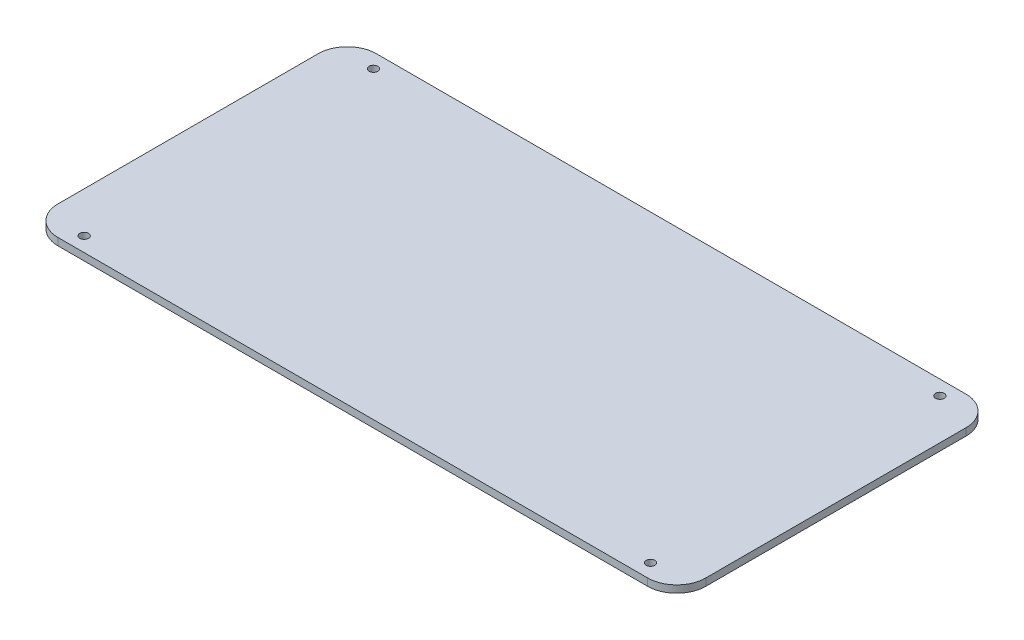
ISO-10303-21;
HEADER;
FILE_DESCRIPTION(('STEP AP214'),'2;1');
FILE_NAME('part.step','',(''),(''),'','','');
FILE_SCHEMA(('AUTOMOTIVE_DESIGN { 1 0 10303 214 1 1 1 1 }'));
ENDSEC;
DATA;
#1=APPLICATION_CONTEXT('core data for automotive mechanical design processes');
#2=APPLICATION_PROTOCOL_DEFINITION('international standard','automotive_design',2000,#1);
#3=PRODUCT_CONTEXT('',#1,'mechanical');
#4=PRODUCT('Part','Part','',(#3));
#5=PRODUCT_RELATED_PRODUCT_CATEGORY('part','',(#4));
#6=PRODUCT_DEFINITION_FORMATION('','',#4);
#7=PRODUCT_DEFINITION_CONTEXT('part definition',#1,'design');
#8=PRODUCT_DEFINITION('design','',#6,#7);
#9=PRODUCT_DEFINITION_SHAPE('','',#8);
#10=(LENGTH_UNIT() NAMED_UNIT(*) SI_UNIT(.MILLI.,.METRE.));
#11=(NAMED_UNIT(*) PLANE_ANGLE_UNIT() SI_UNIT($,.RADIAN.));
#12=(NAMED_UNIT(*) SI_UNIT($,.STERADIAN.) SOLID_ANGLE_UNIT());
#13=UNCERTAINTY_MEASURE_WITH_UNIT(LENGTH_MEASURE(1.E-05),#10,'distance_accuracy_value','');
#14=(GEOMETRIC_REPRESENTATION_CONTEXT(3) GLOBAL_UNCERTAINTY_ASSIGNED_CONTEXT((#13)) GLOBAL_UNIT_ASSIGNED_CONTEXT((#10,
#11,#12)) REPRESENTATION_CONTEXT('',''));
#15=CARTESIAN_POINT('',(0.,0.,0.));
#16=DIRECTION('',(0.,0.,1.));
#17=DIRECTION('',(1.,0.,0.));
#18=AXIS2_PLACEMENT_3D('',#15,#16,#17);
#19=CARTESIAN_POINT('',(111.405,2.5,-54.75));
#20=DIRECTION('',(-1.,0.,0.));
#21=DIRECTION('',(0.,0.,1.));
#22=AXIS2_PLACEMENT_3D('',#19,#20,#21);
#23=PLANE('',#22);
#24=DIRECTION('',(0.,0.,-1.));
#25=VECTOR('',#24,1.);
#26=CARTESIAN_POINT('',(111.405,2.5,-54.75));
#27=LINE('',#26,#25);
#28=CARTESIAN_POINT('',(111.405,2.5,44.75));
#29=VERTEX_POINT('',#28);
#30=CARTESIAN_POINT('',(111.405,2.5,-44.75));
#31=VERTEX_POINT('',#30);
#32=EDGE_CURVE('E120',#29,#31,#27,.T.);
#33=ORIENTED_EDGE('',*,*,#32,.F.);
#34=DIRECTION('',(0.,-1.,0.));
#35=VECTOR('',#34,1.);
#36=CARTESIAN_POINT('',(111.405,2.5,44.75));
#37=LINE('',#36,#35);
#38=CARTESIAN_POINT('',(111.405,0.,44.75));
#39=VERTEX_POINT('',#38);
#40=EDGE_CURVE('E105',#29,#39,#37,.T.);
#41=ORIENTED_EDGE('',*,*,#40,.T.);
#42=DIRECTION('',(0.,0.,-1.));
#43=VECTOR('',#42,1.);
#44=CARTESIAN_POINT('',(111.405,0.,-54.75));
#45=LINE('',#44,#43);
#46=CARTESIAN_POINT('',(111.405,0.,-44.75));
#47=VERTEX_POINT('',#46);
#48=EDGE_CURVE('E117',#39,#47,#45,.T.);
#49=ORIENTED_EDGE('',*,*,#48,.T.);
#50=DIRECTION('',(0.,-1.,0.));
#51=VECTOR('',#50,1.);
#52=CARTESIAN_POINT('',(111.405,2.5,-44.75));
#53=LINE('',#52,#51);
#54=EDGE_CURVE('E122',#47,#31,#53,.F.);
#55=ORIENTED_EDGE('',*,*,#54,.T.);
#56=EDGE_LOOP('',(#33,#41,#49,#55));
#57=FACE_BOUND('',#56,.T.);
#58=ADVANCED_FACE('F33',(#57),#23,.F.);
#59=CARTESIAN_POINT('',(-111.405,2.5,-54.75));
#60=DIRECTION('',(0.,0.,1.));
#61=DIRECTION('',(1.,0.,0.));
#62=AXIS2_PLACEMENT_3D('',#59,#60,#61);
#63=PLANE('',#62);
#64=DIRECTION('',(-1.,0.,0.));
#65=VECTOR('',#64,1.);
#66=CARTESIAN_POINT('',(-111.405,2.5,-54.75));
#67=LINE('',#66,#65);
#68=CARTESIAN_POINT('',(101.405,2.5,-54.75));
#69=VERTEX_POINT('',#68);
#70=CARTESIAN_POINT('',(-101.405,2.5,-54.75));
#71=VERTEX_POINT('',#70);
#72=EDGE_CURVE('E184',#69,#71,#67,.T.);
#73=ORIENTED_EDGE('',*,*,#72,.F.);
#74=DIRECTION('',(0.,-1.,0.));
#75=VECTOR('',#74,1.);
#76=CARTESIAN_POINT('',(101.405,2.5,-54.75));
#77=LINE('',#76,#75);
#78=CARTESIAN_POINT('',(101.405,0.,-54.75));
#79=VERTEX_POINT('',#78);
#80=EDGE_CURVE('E159',#69,#79,#77,.T.);
#81=ORIENTED_EDGE('',*,*,#80,.T.);
#82=DIRECTION('',(-1.,0.,0.));
#83=VECTOR('',#82,1.);
#84=CARTESIAN_POINT('',(-111.405,0.,-54.75));
#85=LINE('',#84,#83);
#86=CARTESIAN_POINT('',(-101.405,0.,-54.75));
#87=VERTEX_POINT('',#86);
#88=EDGE_CURVE('E126',#79,#87,#85,.T.);
#89=ORIENTED_EDGE('',*,*,#88,.T.);
#90=DIRECTION('',(0.,-1.,0.));
#91=VECTOR('',#90,1.);
#92=CARTESIAN_POINT('',(-101.405,2.5,-54.75));
#93=LINE('',#92,#91);
#94=EDGE_CURVE('E157',#87,#71,#93,.F.);
#95=ORIENTED_EDGE('',*,*,#94,.T.);
#96=EDGE_LOOP('',(#73,#81,#89,#95));
#97=FACE_BOUND('',#96,.T.);
#98=ADVANCED_FACE('F202',(#97),#63,.F.);
#99=CARTESIAN_POINT('',(-111.405,2.5,-54.75));
#100=DIRECTION('',(1.,0.,0.));
#101=DIRECTION('',(0.,0.,-1.));
#102=AXIS2_PLACEMENT_3D('',#99,#100,#101);
#103=PLANE('',#102);
#104=DIRECTION('',(0.,0.,1.));
#105=VECTOR('',#104,1.);
#106=CARTESIAN_POINT('',(-111.405,2.5,-54.75));
#107=LINE('',#106,#105);
#108=CARTESIAN_POINT('',(-111.405,2.5,-44.75));
#109=VERTEX_POINT('',#108);
#110=CARTESIAN_POINT('',(-111.405,2.5,44.75));
#111=VERTEX_POINT('',#110);
#112=EDGE_CURVE('E185',#109,#111,#107,.T.);
#113=ORIENTED_EDGE('',*,*,#112,.F.);
#114=DIRECTION('',(0.,-1.,0.));
#115=VECTOR('',#114,1.);
#116=CARTESIAN_POINT('',(-111.405,2.5,-44.75));
#117=LINE('',#116,#115);
#118=CARTESIAN_POINT('',(-111.405,0.,-44.75));
#119=VERTEX_POINT('',#118);
#120=EDGE_CURVE('E11',#109,#119,#117,.T.);
#121=ORIENTED_EDGE('',*,*,#120,.T.);
#122=DIRECTION('',(0.,0.,1.));
#123=VECTOR('',#122,1.);
#124=CARTESIAN_POINT('',(-111.405,0.,-54.75));
#125=LINE('',#124,#123);
#126=CARTESIAN_POINT('',(-111.405,0.,44.75));
#127=VERTEX_POINT('',#126);
#128=EDGE_CURVE('E130',#119,#127,#125,.T.);
#129=ORIENTED_EDGE('',*,*,#128,.T.);
#130=DIRECTION('',(0.,-1.,0.));
#131=VECTOR('',#130,1.);
#132=CARTESIAN_POINT('',(-111.405,2.5,44.75));
#133=LINE('',#132,#131);
#134=EDGE_CURVE('E42',#127,#111,#133,.F.);
#135=ORIENTED_EDGE('',*,*,#134,.T.);
#136=EDGE_LOOP('',(#113,#121,#129,#135));
#137=FACE_BOUND('',#136,.T.);
#138=ADVANCED_FACE('F195',(#137),#103,.F.);
#139=CARTESIAN_POINT('',(-111.405,2.5,54.75));
#140=DIRECTION('',(0.,0.,-1.));
#141=DIRECTION('',(-1.,0.,0.));
#142=AXIS2_PLACEMENT_3D('',#139,#140,#141);
#143=PLANE('',#142);
#144=DIRECTION('',(1.,0.,0.));
#145=VECTOR('',#144,1.);
#146=CARTESIAN_POINT('',(-111.405,0.,54.75));
#147=LINE('',#146,#145);
#148=CARTESIAN_POINT('',(-101.405,0.,54.75));
#149=VERTEX_POINT('',#148);
#150=CARTESIAN_POINT('',(101.405,0.,54.75));
#151=VERTEX_POINT('',#150);
#152=EDGE_CURVE('E140',#149,#151,#147,.T.);
#153=ORIENTED_EDGE('',*,*,#152,.T.);
#154=DIRECTION('',(0.,-1.,0.));
#155=VECTOR('',#154,1.);
#156=CARTESIAN_POINT('',(101.405,2.5,54.75));
#157=LINE('',#156,#155);
#158=CARTESIAN_POINT('',(101.405,2.5,54.75));
#159=VERTEX_POINT('',#158);
#160=EDGE_CURVE('E106',#151,#159,#157,.F.);
#161=ORIENTED_EDGE('',*,*,#160,.T.);
#162=DIRECTION('',(1.,0.,0.));
#163=VECTOR('',#162,1.);
#164=CARTESIAN_POINT('',(-111.405,2.5,54.75));
#165=LINE('',#164,#163);
#166=CARTESIAN_POINT('',(-101.405,2.5,54.75));
#167=VERTEX_POINT('',#166);
#168=EDGE_CURVE('E136',#167,#159,#165,.T.);
#169=ORIENTED_EDGE('',*,*,#168,.F.);
#170=DIRECTION('',(0.,-1.,0.));
#171=VECTOR('',#170,1.);
#172=CARTESIAN_POINT('',(-101.405,2.5,54.75));
#173=LINE('',#172,#171);
#174=EDGE_CURVE('E111',#167,#149,#173,.T.);
#175=ORIENTED_EDGE('',*,*,#174,.T.);
#176=EDGE_LOOP('',(#153,#161,#169,#175));
#177=FACE_BOUND('',#176,.T.);
#178=ADVANCED_FACE('F192',(#177),#143,.F.);
#179=CARTESIAN_POINT('',(0.,2.5,0.));
#180=DIRECTION('',(0.,1.,0.));
#181=DIRECTION('',(0.,0.,1.));
#182=AXIS2_PLACEMENT_3D('',#179,#180,#181);
#183=PLANE('',#182);
#184=CARTESIAN_POINT('',(-97.405,2.5,49.75));
#185=DIRECTION('',(0.,1.,0.));
#186=DIRECTION('',(0.,0.,1.));
#187=AXIS2_PLACEMENT_3D('',#184,#185,#186);
#188=CIRCLE('',#187,1.5);
#189=CARTESIAN_POINT('',(-97.405,2.5,51.25));
#190=VERTEX_POINT('',#189);
#191=EDGE_CURVE('E165',#190,#190,#188,.F.);
#192=ORIENTED_EDGE('',*,*,#191,.T.);
#193=EDGE_LOOP('',(#192));
#194=FACE_BOUND('',#193,.T.);
#195=CARTESIAN_POINT('',(97.405,2.5,-49.75));
#196=DIRECTION('',(0.,1.,0.));
#197=DIRECTION('',(0.,0.,1.));
#198=AXIS2_PLACEMENT_3D('',#195,#196,#197);
#199=CIRCLE('',#198,1.5);
#200=CARTESIAN_POINT('',(97.405,2.5,-48.25));
#201=VERTEX_POINT('',#200);
#202=EDGE_CURVE('E171',#201,#201,#199,.F.);
#203=ORIENTED_EDGE('',*,*,#202,.T.);
#204=EDGE_LOOP('',(#203));
#205=FACE_BOUND('',#204,.T.);
#206=CARTESIAN_POINT('',(97.405,2.5,49.75));
#207=DIRECTION('',(0.,1.,0.));
#208=DIRECTION('',(0.,0.,1.));
#209=AXIS2_PLACEMENT_3D('',#206,#207,#208);
#210=CIRCLE('',#209,1.5);
#211=CARTESIAN_POINT('',(97.405,2.5,51.25));
#212=VERTEX_POINT('',#211);
#213=EDGE_CURVE('E168',#212,#212,#210,.F.);
#214=ORIENTED_EDGE('',*,*,#213,.T.);
#215=EDGE_LOOP('',(#214));
#216=FACE_BOUND('',#215,.T.);
#217=CARTESIAN_POINT('',(-97.405,2.5,-49.75));
#218=DIRECTION('',(0.,1.,0.));
#219=DIRECTION('',(0.,0.,1.));
#220=AXIS2_PLACEMENT_3D('',#217,#218,#219);
#221=CIRCLE('',#220,1.5);
#222=CARTESIAN_POINT('',(-97.405,2.5,-48.25));
#223=VERTEX_POINT('',#222);
#224=EDGE_CURVE('E127',#223,#223,#221,.F.);
#225=ORIENTED_EDGE('',*,*,#224,.T.);
#226=EDGE_LOOP('',(#225));
#227=FACE_BOUND('',#226,.T.);
#228=ORIENTED_EDGE('',*,*,#168,.T.);
#229=CARTESIAN_POINT('',(101.405,2.5,44.75));
#230=DIRECTION('',(0.,1.,0.));
#231=DIRECTION('',(0.,0.,1.));
#232=AXIS2_PLACEMENT_3D('',#229,#230,#231);
#233=CIRCLE('',#232,10.);
#234=EDGE_CURVE('E155',#159,#29,#233,.T.);
#235=ORIENTED_EDGE('',*,*,#234,.T.);
#236=ORIENTED_EDGE('',*,*,#32,.T.);
#237=CARTESIAN_POINT('',(101.405,2.5,-44.75));
#238=DIRECTION('',(0.,1.,0.));
#239=DIRECTION('',(0.,0.,1.));
#240=AXIS2_PLACEMENT_3D('',#237,#238,#239);
#241=CIRCLE('',#240,10.);
#242=EDGE_CURVE('E153',#31,#69,#241,.T.);
#243=ORIENTED_EDGE('',*,*,#242,.T.);
#244=ORIENTED_EDGE('',*,*,#72,.T.);
#245=CARTESIAN_POINT('',(-101.405,2.5,-44.75));
#246=DIRECTION('',(0.,1.,0.));
#247=DIRECTION('',(0.,0.,1.));
#248=AXIS2_PLACEMENT_3D('',#245,#246,#247);
#249=CIRCLE('',#248,10.);
#250=EDGE_CURVE('E56',#71,#109,#249,.T.);
#251=ORIENTED_EDGE('',*,*,#250,.T.);
#252=ORIENTED_EDGE('',*,*,#112,.T.);
#253=CARTESIAN_POINT('',(-101.405,2.5,44.75));
#254=DIRECTION('',(0.,1.,0.));
#255=DIRECTION('',(0.,0.,1.));
#256=AXIS2_PLACEMENT_3D('',#253,#254,#255);
#257=CIRCLE('',#256,10.);
#258=EDGE_CURVE('E150',#111,#167,#257,.T.);
#259=ORIENTED_EDGE('',*,*,#258,.T.);
#260=EDGE_LOOP('',(#228,#235,#236,#243,#244,#251,#252,#259));
#261=FACE_BOUND('',#260,.T.);
#262=ADVANCED_FACE('F189',(#194,#205,#216,#227,#261),#183,.T.);
#263=CARTESIAN_POINT('',(0.,0.,0.));
#264=DIRECTION('',(0.,1.,0.));
#265=DIRECTION('',(0.,0.,1.));
#266=AXIS2_PLACEMENT_3D('',#263,#264,#265);
#267=PLANE('',#266);
#268=CARTESIAN_POINT('',(-97.405,0.,49.75));
#269=DIRECTION('',(0.,1.,0.));
#270=DIRECTION('',(0.,0.,1.));
#271=AXIS2_PLACEMENT_3D('',#268,#269,#270);
#272=CIRCLE('',#271,1.5);
#273=CARTESIAN_POINT('',(-97.405,0.,51.25));
#274=VERTEX_POINT('',#273);
#275=EDGE_CURVE('E37',#274,#274,#272,.F.);
#276=ORIENTED_EDGE('',*,*,#275,.F.);
#277=EDGE_LOOP('',(#276));
#278=FACE_BOUND('',#277,.T.);
#279=CARTESIAN_POINT('',(97.405,0.,-49.75));
#280=DIRECTION('',(0.,1.,0.));
#281=DIRECTION('',(0.,0.,1.));
#282=AXIS2_PLACEMENT_3D('',#279,#280,#281);
#283=CIRCLE('',#282,1.5);
#284=CARTESIAN_POINT('',(97.405,0.,-48.25));
#285=VERTEX_POINT('',#284);
#286=EDGE_CURVE('E169',#285,#285,#283,.F.);
#287=ORIENTED_EDGE('',*,*,#286,.F.);
#288=EDGE_LOOP('',(#287));
#289=FACE_BOUND('',#288,.T.);
#290=CARTESIAN_POINT('',(97.405,0.,49.75));
#291=DIRECTION('',(0.,1.,0.));
#292=DIRECTION('',(0.,0.,1.));
#293=AXIS2_PLACEMENT_3D('',#290,#291,#292);
#294=CIRCLE('',#293,1.5);
#295=CARTESIAN_POINT('',(97.405,0.,51.25));
#296=VERTEX_POINT('',#295);
#297=EDGE_CURVE('E166',#296,#296,#294,.F.);
#298=ORIENTED_EDGE('',*,*,#297,.F.);
#299=EDGE_LOOP('',(#298));
#300=FACE_BOUND('',#299,.T.);
#301=CARTESIAN_POINT('',(-97.405,0.,-49.75));
#302=DIRECTION('',(0.,1.,0.));
#303=DIRECTION('',(0.,0.,1.));
#304=AXIS2_PLACEMENT_3D('',#301,#302,#303);
#305=CIRCLE('',#304,1.5);
#306=CARTESIAN_POINT('',(-97.405,0.,-48.25));
#307=VERTEX_POINT('',#306);
#308=EDGE_CURVE('E133',#307,#307,#305,.F.);
#309=ORIENTED_EDGE('',*,*,#308,.F.);
#310=EDGE_LOOP('',(#309));
#311=FACE_BOUND('',#310,.T.);
#312=ORIENTED_EDGE('',*,*,#48,.F.);
#313=CARTESIAN_POINT('',(101.405,0.,44.75));
#314=DIRECTION('',(0.,1.,0.));
#315=DIRECTION('',(0.,0.,1.));
#316=AXIS2_PLACEMENT_3D('',#313,#314,#315);
#317=CIRCLE('',#316,10.);
#318=EDGE_CURVE('E101',#39,#151,#317,.F.);
#319=ORIENTED_EDGE('',*,*,#318,.T.);
#320=ORIENTED_EDGE('',*,*,#152,.F.);
#321=CARTESIAN_POINT('',(-101.405,0.,44.75));
#322=DIRECTION('',(0.,1.,0.));
#323=DIRECTION('',(0.,0.,1.));
#324=AXIS2_PLACEMENT_3D('',#321,#322,#323);
#325=CIRCLE('',#324,10.);
#326=EDGE_CURVE('E121',#149,#127,#325,.F.);
#327=ORIENTED_EDGE('',*,*,#326,.T.);
#328=ORIENTED_EDGE('',*,*,#128,.F.);
#329=CARTESIAN_POINT('',(-101.405,0.,-44.75));
#330=DIRECTION('',(0.,1.,0.));
#331=DIRECTION('',(0.,0.,1.));
#332=AXIS2_PLACEMENT_3D('',#329,#330,#331);
#333=CIRCLE('',#332,10.);
#334=EDGE_CURVE('E144',#119,#87,#333,.F.);
#335=ORIENTED_EDGE('',*,*,#334,.T.);
#336=ORIENTED_EDGE('',*,*,#88,.F.);
#337=CARTESIAN_POINT('',(101.405,0.,-44.75));
#338=DIRECTION('',(0.,1.,0.));
#339=DIRECTION('',(0.,0.,1.));
#340=AXIS2_PLACEMENT_3D('',#337,#338,#339);
#341=CIRCLE('',#340,10.);
#342=EDGE_CURVE('E112',#79,#47,#341,.F.);
#343=ORIENTED_EDGE('',*,*,#342,.T.);
#344=EDGE_LOOP('',(#312,#319,#320,#327,#328,#335,#336,#343));
#345=FACE_BOUND('',#344,.T.);
#346=ADVANCED_FACE('F124',(#278,#289,#300,#311,#345),#267,.F.);
#347=CARTESIAN_POINT('',(101.405,2.5,44.75));
#348=DIRECTION('',(0.,-1.,0.));
#349=DIRECTION('',(0.,0.,-1.));
#350=AXIS2_PLACEMENT_3D('',#347,#348,#349);
#351=CYLINDRICAL_SURFACE('',#350,10.);
#352=ORIENTED_EDGE('',*,*,#234,.F.);
#353=ORIENTED_EDGE('',*,*,#160,.F.);
#354=ORIENTED_EDGE('',*,*,#318,.F.);
#355=ORIENTED_EDGE('',*,*,#40,.F.);
#356=EDGE_LOOP('',(#352,#353,#354,#355));
#357=FACE_BOUND('',#356,.T.);
#358=ADVANCED_FACE('F104',(#357),#351,.T.);
#359=CARTESIAN_POINT('',(101.405,2.5,-44.75));
#360=DIRECTION('',(0.,-1.,0.));
#361=DIRECTION('',(0.,0.,-1.));
#362=AXIS2_PLACEMENT_3D('',#359,#360,#361);
#363=CYLINDRICAL_SURFACE('',#362,10.);
#364=ORIENTED_EDGE('',*,*,#242,.F.);
#365=ORIENTED_EDGE('',*,*,#54,.F.);
#366=ORIENTED_EDGE('',*,*,#342,.F.);
#367=ORIENTED_EDGE('',*,*,#80,.F.);
#368=EDGE_LOOP('',(#364,#365,#366,#367));
#369=FACE_BOUND('',#368,.T.);
#370=ADVANCED_FACE('F206',(#369),#363,.T.);
#371=CARTESIAN_POINT('',(-101.405,2.5,-44.75));
#372=DIRECTION('',(0.,-1.,0.));
#373=DIRECTION('',(0.,0.,-1.));
#374=AXIS2_PLACEMENT_3D('',#371,#372,#373);
#375=CYLINDRICAL_SURFACE('',#374,10.);
#376=ORIENTED_EDGE('',*,*,#250,.F.);
#377=ORIENTED_EDGE('',*,*,#94,.F.);
#378=ORIENTED_EDGE('',*,*,#334,.F.);
#379=ORIENTED_EDGE('',*,*,#120,.F.);
#380=EDGE_LOOP('',(#376,#377,#378,#379));
#381=FACE_BOUND('',#380,.T.);
#382=ADVANCED_FACE('F198',(#381),#375,.T.);
#383=CARTESIAN_POINT('',(-101.405,2.5,44.75));
#384=DIRECTION('',(0.,-1.,0.));
#385=DIRECTION('',(0.,0.,-1.));
#386=AXIS2_PLACEMENT_3D('',#383,#384,#385);
#387=CYLINDRICAL_SURFACE('',#386,10.);
#388=ORIENTED_EDGE('',*,*,#258,.F.);
#389=ORIENTED_EDGE('',*,*,#134,.F.);
#390=ORIENTED_EDGE('',*,*,#326,.F.);
#391=ORIENTED_EDGE('',*,*,#174,.F.);
#392=EDGE_LOOP('',(#388,#389,#390,#391));
#393=FACE_BOUND('',#392,.T.);
#394=ADVANCED_FACE('F35',(#393),#387,.T.);
#395=CARTESIAN_POINT('',(-97.405,8.,-49.75));
#396=DIRECTION('',(0.,-1.,0.));
#397=DIRECTION('',(0.,0.,-1.));
#398=AXIS2_PLACEMENT_3D('',#395,#396,#397);
#399=CYLINDRICAL_SURFACE('',#398,1.5);
#400=ORIENTED_EDGE('',*,*,#224,.F.);
#401=EDGE_LOOP('',(#400));
#402=FACE_BOUND('',#401,.T.);
#403=ORIENTED_EDGE('',*,*,#308,.T.);
#404=EDGE_LOOP('',(#403));
#405=FACE_BOUND('',#404,.T.);
#406=ADVANCED_FACE('F231',(#402,#405),#399,.F.);
#407=CARTESIAN_POINT('',(97.405,8.,49.75));
#408=DIRECTION('',(0.,-1.,0.));
#409=DIRECTION('',(0.,0.,-1.));
#410=AXIS2_PLACEMENT_3D('',#407,#408,#409);
#411=CYLINDRICAL_SURFACE('',#410,1.5);
#412=ORIENTED_EDGE('',*,*,#213,.F.);
#413=EDGE_LOOP('',(#412));
#414=FACE_BOUND('',#413,.T.);
#415=ORIENTED_EDGE('',*,*,#297,.T.);
#416=EDGE_LOOP('',(#415));
#417=FACE_BOUND('',#416,.T.);
#418=ADVANCED_FACE('F234',(#414,#417),#411,.F.);
#419=CARTESIAN_POINT('',(97.405,8.,-49.75));
#420=DIRECTION('',(0.,-1.,0.));
#421=DIRECTION('',(0.,0.,-1.));
#422=AXIS2_PLACEMENT_3D('',#419,#420,#421);
#423=CYLINDRICAL_SURFACE('',#422,1.5);
#424=ORIENTED_EDGE('',*,*,#202,.F.);
#425=EDGE_LOOP('',(#424));
#426=FACE_BOUND('',#425,.T.);
#427=ORIENTED_EDGE('',*,*,#286,.T.);
#428=EDGE_LOOP('',(#427));
#429=FACE_BOUND('',#428,.T.);
#430=ADVANCED_FACE('F238',(#426,#429),#423,.F.);
#431=CARTESIAN_POINT('',(-97.405,8.,49.75));
#432=DIRECTION('',(0.,-1.,0.));
#433=DIRECTION('',(0.,0.,-1.));
#434=AXIS2_PLACEMENT_3D('',#431,#432,#433);
#435=CYLINDRICAL_SURFACE('',#434,1.5);
#436=ORIENTED_EDGE('',*,*,#191,.F.);
#437=EDGE_LOOP('',(#436));
#438=FACE_BOUND('',#437,.T.);
#439=ORIENTED_EDGE('',*,*,#275,.T.);
#440=EDGE_LOOP('',(#439));
#441=FACE_BOUND('',#440,.T.);
#442=ADVANCED_FACE('F242',(#438,#441),#435,.F.);
#443=CLOSED_SHELL('',(#58,#98,#138,#178,#262,#346,#358,#370,#382,#394,#406,#418,#430,#442));
#444=MANIFOLD_SOLID_BREP('B2',#443);
#445=ADVANCED_BREP_SHAPE_REPRESENTATION('',(#18,#444),#14);
#446=SHAPE_DEFINITION_REPRESENTATION(#9,#445);
ENDSEC;
END-ISO-10303-21;
